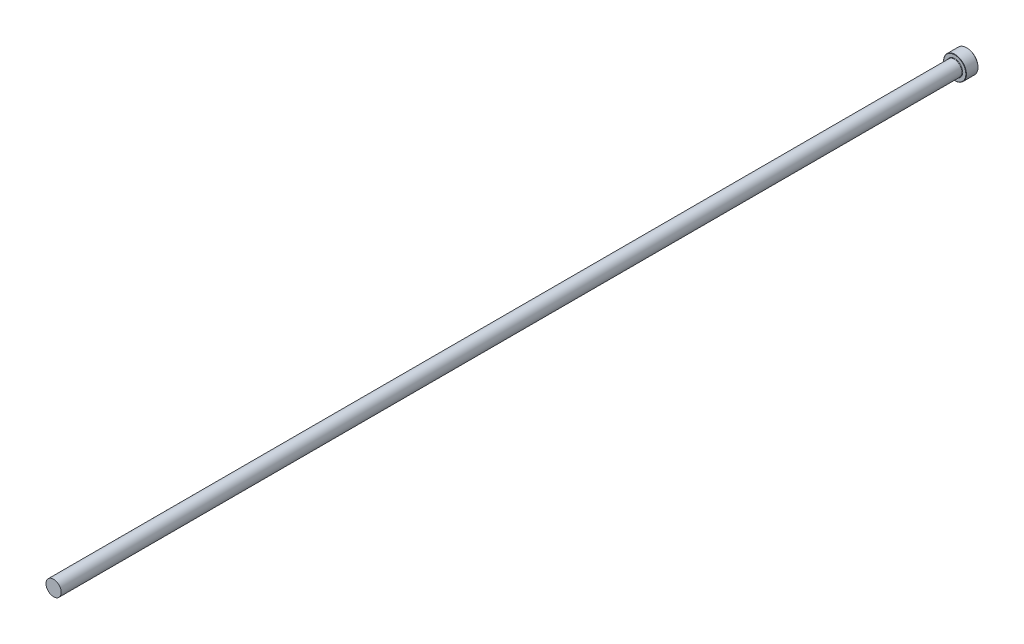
ISO-10303-21;
HEADER;
FILE_DESCRIPTION(('STEP AP214'),'2;1');
FILE_NAME('part.step','',(''),(''),'','','');
FILE_SCHEMA(('AUTOMOTIVE_DESIGN { 1 0 10303 214 1 1 1 1 }'));
ENDSEC;
DATA;
#1=APPLICATION_CONTEXT('core data for automotive mechanical design processes');
#2=APPLICATION_PROTOCOL_DEFINITION('international standard','automotive_design',2000,#1);
#3=PRODUCT_CONTEXT('',#1,'mechanical');
#4=PRODUCT('Part','Part','',(#3));
#5=PRODUCT_RELATED_PRODUCT_CATEGORY('part','',(#4));
#6=PRODUCT_DEFINITION_FORMATION('','',#4);
#7=PRODUCT_DEFINITION_CONTEXT('part definition',#1,'design');
#8=PRODUCT_DEFINITION('design','',#6,#7);
#9=PRODUCT_DEFINITION_SHAPE('','',#8);
#10=(LENGTH_UNIT() NAMED_UNIT(*) SI_UNIT(.MILLI.,.METRE.));
#11=(NAMED_UNIT(*) PLANE_ANGLE_UNIT() SI_UNIT($,.RADIAN.));
#12=(NAMED_UNIT(*) SI_UNIT($,.STERADIAN.) SOLID_ANGLE_UNIT());
#13=UNCERTAINTY_MEASURE_WITH_UNIT(LENGTH_MEASURE(1.E-05),#10,'distance_accuracy_value','');
#14=(GEOMETRIC_REPRESENTATION_CONTEXT(3) GLOBAL_UNCERTAINTY_ASSIGNED_CONTEXT((#13)) GLOBAL_UNIT_ASSIGNED_CONTEXT((#10,
#11,#12)) REPRESENTATION_CONTEXT('',''));
#15=CARTESIAN_POINT('',(0.,0.,0.));
#16=DIRECTION('',(0.,0.,1.));
#17=DIRECTION('',(1.,0.,0.));
#18=AXIS2_PLACEMENT_3D('',#15,#16,#17);
#19=CARTESIAN_POINT('',(0.,4.99999999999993,600.));
#20=DIRECTION('',(0.,0.,-1.));
#21=DIRECTION('',(-1.,0.,0.));
#22=AXIS2_PLACEMENT_3D('',#19,#20,#21);
#23=PLANE('',#22);
#24=CARTESIAN_POINT('',(0.,0.,600.));
#25=DIRECTION('',(0.,0.,1.));
#26=DIRECTION('',(1.,0.,0.));
#27=AXIS2_PLACEMENT_3D('',#24,#25,#26);
#28=CIRCLE('',#27,4.99999999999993);
#29=CARTESIAN_POINT('',(4.99999999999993,0.,600.));
#30=VERTEX_POINT('',#29);
#31=EDGE_CURVE('E50',#30,#30,#28,.T.);
#32=ORIENTED_EDGE('',*,*,#31,.T.);
#33=EDGE_LOOP('',(#32));
#34=FACE_BOUND('',#33,.T.);
#35=ADVANCED_FACE('F30',(#34),#23,.F.);
#36=CARTESIAN_POINT('',(0.,0.,109.050628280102));
#37=DIRECTION('',(0.,0.,1.));
#38=DIRECTION('',(1.,0.,0.));
#39=AXIS2_PLACEMENT_3D('',#36,#37,#38);
#40=CYLINDRICAL_SURFACE('',#39,4.99999999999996);
#41=ORIENTED_EDGE('',*,*,#31,.F.);
#42=EDGE_LOOP('',(#41));
#43=FACE_BOUND('',#42,.T.);
#44=CARTESIAN_POINT('',(0.,0.,8.3));
#45=DIRECTION('',(0.,0.,1.));
#46=DIRECTION('',(1.,0.,0.));
#47=AXIS2_PLACEMENT_3D('',#44,#45,#46);
#48=CIRCLE('',#47,5.);
#49=CARTESIAN_POINT('',(5.,0.,8.3));
#50=VERTEX_POINT('',#49);
#51=EDGE_CURVE('E53',#50,#50,#48,.T.);
#52=ORIENTED_EDGE('',*,*,#51,.T.);
#53=EDGE_LOOP('',(#52));
#54=FACE_BOUND('',#53,.T.);
#55=ADVANCED_FACE('F73',(#43,#54),#40,.T.);
#56=CARTESIAN_POINT('',(0.,0.,8.3));
#57=DIRECTION('',(0.,0.,1.));
#58=DIRECTION('',(1.,0.,0.));
#59=AXIS2_PLACEMENT_3D('',#56,#57,#58);
#60=TOROIDAL_SURFACE('',#59,5.3,0.3);
#61=ORIENTED_EDGE('',*,*,#51,.F.);
#62=EDGE_LOOP('',(#61));
#63=FACE_BOUND('',#62,.T.);
#64=CARTESIAN_POINT('',(0.,0.,8.00000000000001));
#65=DIRECTION('',(0.,0.,1.));
#66=DIRECTION('',(1.,0.,0.));
#67=AXIS2_PLACEMENT_3D('',#64,#65,#66);
#68=CIRCLE('',#67,5.3);
#69=CARTESIAN_POINT('',(5.3,0.,8.00000000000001));
#70=VERTEX_POINT('',#69);
#71=EDGE_CURVE('E56',#70,#70,#68,.T.);
#72=ORIENTED_EDGE('',*,*,#71,.T.);
#73=EDGE_LOOP('',(#72));
#74=FACE_BOUND('',#73,.T.);
#75=ADVANCED_FACE('F60',(#63,#74),#60,.F.);
#76=CARTESIAN_POINT('',(0.,7.5,8.));
#77=DIRECTION('',(0.,0.,-1.));
#78=DIRECTION('',(-1.,0.,0.));
#79=AXIS2_PLACEMENT_3D('',#76,#77,#78);
#80=PLANE('',#79);
#81=CARTESIAN_POINT('',(0.,0.,8.));
#82=DIRECTION('',(0.,0.,-1.));
#83=DIRECTION('',(-1.,0.,0.));
#84=AXIS2_PLACEMENT_3D('',#81,#82,#83);
#85=CIRCLE('',#84,7.30000000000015);
#86=CARTESIAN_POINT('',(-7.30000000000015,0.,8.));
#87=VERTEX_POINT('',#86);
#88=EDGE_CURVE('E10',#87,#87,#85,.F.);
#89=ORIENTED_EDGE('',*,*,#88,.T.);
#90=EDGE_LOOP('',(#89));
#91=FACE_BOUND('',#90,.T.);
#92=ORIENTED_EDGE('',*,*,#71,.F.);
#93=EDGE_LOOP('',(#92));
#94=FACE_BOUND('',#93,.T.);
#95=ADVANCED_FACE('F62',(#91,#94),#80,.F.);
#96=CARTESIAN_POINT('',(0.,0.,109.050628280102));
#97=DIRECTION('',(0.,0.,1.));
#98=DIRECTION('',(1.,0.,0.));
#99=AXIS2_PLACEMENT_3D('',#96,#97,#98);
#100=CYLINDRICAL_SURFACE('',#99,7.5);
#101=CARTESIAN_POINT('',(0.,0.,0.200000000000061));
#102=DIRECTION('',(0.,0.,1.));
#103=DIRECTION('',(1.,0.,0.));
#104=AXIS2_PLACEMENT_3D('',#101,#102,#103);
#105=CIRCLE('',#104,7.5);
#106=CARTESIAN_POINT('',(7.5,0.,0.200000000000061));
#107=VERTEX_POINT('',#106);
#108=EDGE_CURVE('E41',#107,#107,#105,.T.);
#109=ORIENTED_EDGE('',*,*,#108,.T.);
#110=EDGE_LOOP('',(#109));
#111=FACE_BOUND('',#110,.T.);
#112=CARTESIAN_POINT('',(0.,0.,7.80000000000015));
#113=DIRECTION('',(0.,0.,-1.));
#114=DIRECTION('',(-1.,0.,0.));
#115=AXIS2_PLACEMENT_3D('',#112,#113,#114);
#116=CIRCLE('',#115,7.5);
#117=CARTESIAN_POINT('',(-7.5,0.,7.80000000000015));
#118=VERTEX_POINT('',#117);
#119=EDGE_CURVE('E45',#118,#118,#116,.T.);
#120=ORIENTED_EDGE('',*,*,#119,.T.);
#121=EDGE_LOOP('',(#120));
#122=FACE_BOUND('',#121,.T.);
#123=ADVANCED_FACE('F64',(#111,#122),#100,.T.);
#124=CARTESIAN_POINT('',(0.,0.,0.));
#125=DIRECTION('',(0.,0.,1.));
#126=DIRECTION('',(1.,0.,0.));
#127=AXIS2_PLACEMENT_3D('',#124,#125,#126);
#128=PLANE('',#127);
#129=CARTESIAN_POINT('',(0.,0.,0.));
#130=DIRECTION('',(0.,0.,1.));
#131=DIRECTION('',(1.,0.,0.));
#132=AXIS2_PLACEMENT_3D('',#129,#130,#131);
#133=CIRCLE('',#132,7.29999999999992);
#134=CARTESIAN_POINT('',(7.29999999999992,0.,0.));
#135=VERTEX_POINT('',#134);
#136=EDGE_CURVE('E37',#135,#135,#133,.F.);
#137=ORIENTED_EDGE('',*,*,#136,.T.);
#138=EDGE_LOOP('',(#137));
#139=FACE_BOUND('',#138,.T.);
#140=ADVANCED_FACE('F70',(#139),#128,.F.);
#141=CARTESIAN_POINT('',(0.,0.,0.200000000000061));
#142=DIRECTION('',(0.,0.,1.));
#143=DIRECTION('',(1.,0.,0.));
#144=AXIS2_PLACEMENT_3D('',#141,#142,#143);
#145=CONICAL_SURFACE('',#144,7.5,0.785398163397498);
#146=ORIENTED_EDGE('',*,*,#136,.F.);
#147=EDGE_LOOP('',(#146));
#148=FACE_BOUND('',#147,.T.);
#149=ORIENTED_EDGE('',*,*,#108,.F.);
#150=EDGE_LOOP('',(#149));
#151=FACE_BOUND('',#150,.T.);
#152=ADVANCED_FACE('F84',(#148,#151),#145,.T.);
#153=CARTESIAN_POINT('',(0.,0.,8.00000000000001));
#154=DIRECTION('',(0.,0.,-1.));
#155=DIRECTION('',(-1.,0.,0.));
#156=AXIS2_PLACEMENT_3D('',#153,#154,#155);
#157=CONICAL_SURFACE('',#156,7.30000000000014,0.785398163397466);
#158=ORIENTED_EDGE('',*,*,#119,.F.);
#159=EDGE_LOOP('',(#158));
#160=FACE_BOUND('',#159,.T.);
#161=ORIENTED_EDGE('',*,*,#88,.F.);
#162=EDGE_LOOP('',(#161));
#163=FACE_BOUND('',#162,.T.);
#164=ADVANCED_FACE('F32',(#160,#163),#157,.T.);
#165=CLOSED_SHELL('',(#35,#55,#75,#95,#123,#140,#152,#164));
#166=MANIFOLD_SOLID_BREP('B2',#165);
#167=ADVANCED_BREP_SHAPE_REPRESENTATION('',(#18,#166),#14);
#168=SHAPE_DEFINITION_REPRESENTATION(#9,#167);
ENDSEC;
END-ISO-10303-21;
